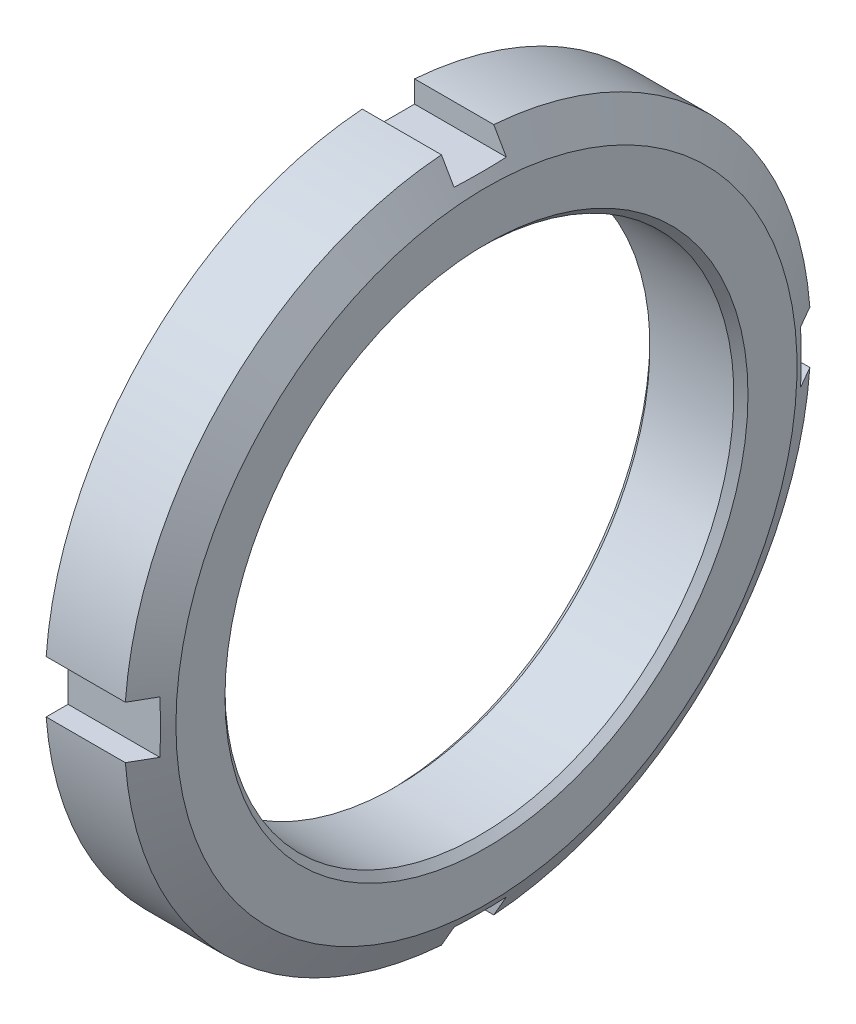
from build123d import *

# Parameters (mm, degrees)
ESQUISSE3_W             = 210
ESQUISSE3_H             = 210
ENL_V_MAT_EXTRU_1_DEPTH = 15


with BuildPart() as part:
    # Esquisse1 → R_volution1 (revolve)
    with BuildSketch(Plane.XY, mode=Mode.PRIVATE) as r_volution1_sk:
        Polygon((0, 0), (0, 52.5), (12.113248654, 52.5), (15, 47.5), (15, 0), align=None)
    revolve(r_volution1_sk.sketch.rotate(Axis((15, 0, 0), (-1, 0, 0)), 270), axis=Axis((15, 0, 0), (-1, 0, 0)))

    # Esquisse2 → Enl_vement de mati_re-R_volution1 (revolve, cut)
    with BuildSketch(Plane.XY, mode=Mode.PRIVATE) as enl_vement_de_mati_re_r_volution1_sk:
        Polygon((0, 0), (0, 40), (1.0825, 38.9175), (13.9175, 38.9175), (15, 40), (15, 0), align=None)
    revolve(enl_vement_de_mati_re_r_volution1_sk.sketch.rotate(Axis((15, 0, 0), (-1, 0, 0)), 270), axis=Axis((15, 0, 0), (-1, 0, 0)), mode=Mode.SUBTRACT)

    # Esquisse3 → Enl_v. mat.-Extru.1 (cut)
    with BuildSketch(Plane(origin=(0, 0, 0), x_dir=(0, 0, -1), z_dir=(1, 0, 0))):
        Rectangle(ESQUISSE3_W, ESQUISSE3_H)
        Polygon((-52.5, 4), (-49, 4), (-49, -4), (-52.5, -4), (-52.5, -52.5), (-4, -52.5), (-4, -49), (4, -49), (4, -52.5), (52.5, -52.5), (52.5, -4), (49, -4), (49, 4), (52.5, 4), (52.5, 52.5), (4, 52.5), (4, 49), (-4, 49), (-4, 52.5), (-52.5, 52.5), align=None, mode=Mode.SUBTRACT)
    extrude(amount=ENL_V_MAT_EXTRU_1_DEPTH, mode=Mode.SUBTRACT)


solid = part.part
